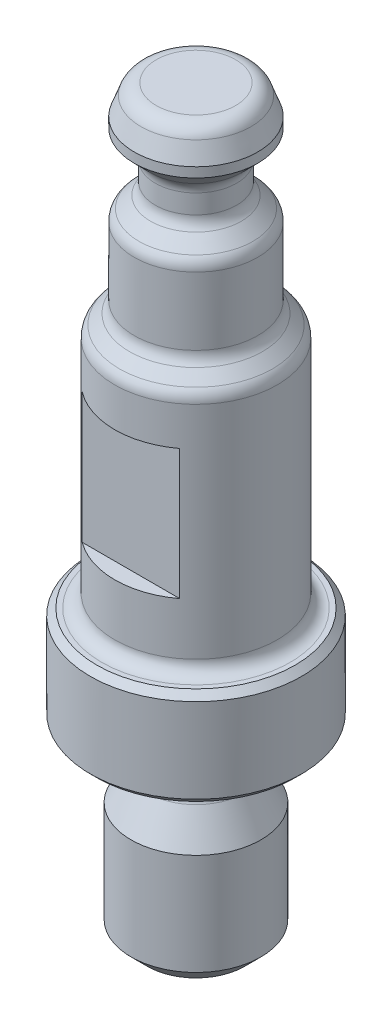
ISO-10303-21;
HEADER;
FILE_DESCRIPTION(('STEP AP214'),'2;1');
FILE_NAME('part.step','',(''),(''),'','','');
FILE_SCHEMA(('AUTOMOTIVE_DESIGN { 1 0 10303 214 1 1 1 1 }'));
ENDSEC;
DATA;
#1=APPLICATION_CONTEXT('core data for automotive mechanical design processes');
#2=APPLICATION_PROTOCOL_DEFINITION('international standard','automotive_design',2000,#1);
#3=PRODUCT_CONTEXT('',#1,'mechanical');
#4=PRODUCT('Part','Part','',(#3));
#5=PRODUCT_RELATED_PRODUCT_CATEGORY('part','',(#4));
#6=PRODUCT_DEFINITION_FORMATION('','',#4);
#7=PRODUCT_DEFINITION_CONTEXT('part definition',#1,'design');
#8=PRODUCT_DEFINITION('design','',#6,#7);
#9=PRODUCT_DEFINITION_SHAPE('','',#8);
#10=(LENGTH_UNIT() NAMED_UNIT(*) SI_UNIT(.MILLI.,.METRE.));
#11=(NAMED_UNIT(*) PLANE_ANGLE_UNIT() SI_UNIT($,.RADIAN.));
#12=(NAMED_UNIT(*) SI_UNIT($,.STERADIAN.) SOLID_ANGLE_UNIT());
#13=UNCERTAINTY_MEASURE_WITH_UNIT(LENGTH_MEASURE(1.E-05),#10,'distance_accuracy_value','');
#14=(GEOMETRIC_REPRESENTATION_CONTEXT(3) GLOBAL_UNCERTAINTY_ASSIGNED_CONTEXT((#13)) GLOBAL_UNIT_ASSIGNED_CONTEXT((#10,
#11,#12)) REPRESENTATION_CONTEXT('',''));
#15=CARTESIAN_POINT('',(0.,0.,0.));
#16=DIRECTION('',(0.,0.,1.));
#17=DIRECTION('',(1.,0.,0.));
#18=AXIS2_PLACEMENT_3D('',#15,#16,#17);
#19=CARTESIAN_POINT('',(0.,0.,0.));
#20=DIRECTION('',(0.,-1.,0.));
#21=DIRECTION('',(0.,0.,-1.));
#22=AXIS2_PLACEMENT_3D('',#19,#20,#21);
#23=CYLINDRICAL_SURFACE('',#22,1.9);
#24=CARTESIAN_POINT('',(0.,16.1,0.));
#25=DIRECTION('',(0.,-1.,0.));
#26=DIRECTION('',(0.,0.,-1.));
#27=AXIS2_PLACEMENT_3D('',#24,#25,#26);
#28=CIRCLE('',#27,1.9);
#29=CARTESIAN_POINT('',(0.,16.1,-1.9));
#30=VERTEX_POINT('',#29);
#31=EDGE_CURVE('E105',#30,#30,#28,.T.);
#32=ORIENTED_EDGE('',*,*,#31,.T.);
#33=EDGE_LOOP('',(#32));
#34=FACE_BOUND('',#33,.T.);
#35=CARTESIAN_POINT('',(0.,15.8,0.));
#36=DIRECTION('',(0.,-1.,0.));
#37=DIRECTION('',(0.,0.,-1.));
#38=AXIS2_PLACEMENT_3D('',#35,#36,#37);
#39=CIRCLE('',#38,1.9);
#40=CARTESIAN_POINT('',(0.,15.8,-1.9));
#41=VERTEX_POINT('',#40);
#42=EDGE_CURVE('E87',#41,#41,#39,.T.);
#43=ORIENTED_EDGE('',*,*,#42,.F.);
#44=EDGE_LOOP('',(#43));
#45=FACE_BOUND('',#44,.T.);
#46=ADVANCED_FACE('F15',(#34,#45),#23,.T.);
#47=CARTESIAN_POINT('',(0.,16.1,0.));
#48=DIRECTION('',(0.,-1.,0.));
#49=DIRECTION('',(0.,0.,-1.));
#50=AXIS2_PLACEMENT_3D('',#47,#48,#49);
#51=CONICAL_SURFACE('',#50,1.9,0.349065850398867);
#52=CARTESIAN_POINT('',(0.,16.6710100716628,0.));
#53=DIRECTION('',(0.,1.,0.));
#54=DIRECTION('',(0.,0.,1.));
#55=AXIS2_PLACEMENT_3D('',#52,#53,#54);
#56=CIRCLE('',#55,1.69216933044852);
#57=CARTESIAN_POINT('',(0.,16.6710100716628,1.69216933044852));
#58=VERTEX_POINT('',#57);
#59=EDGE_CURVE('E109',#58,#58,#56,.F.);
#60=ORIENTED_EDGE('',*,*,#59,.T.);
#61=EDGE_LOOP('',(#60));
#62=FACE_BOUND('',#61,.T.);
#63=ORIENTED_EDGE('',*,*,#31,.F.);
#64=EDGE_LOOP('',(#63));
#65=FACE_BOUND('',#64,.T.);
#66=ADVANCED_FACE('F225',(#62,#65),#51,.T.);
#67=CARTESIAN_POINT('',(0.,17.,0.));
#68=DIRECTION('',(0.,1.,0.));
#69=DIRECTION('',(0.,0.,1.));
#70=AXIS2_PLACEMENT_3D('',#67,#68,#69);
#71=PLANE('',#70);
#72=CARTESIAN_POINT('',(0.,17.,0.));
#73=DIRECTION('',(0.,1.,0.));
#74=DIRECTION('',(0.,0.,1.));
#75=AXIS2_PLACEMENT_3D('',#72,#73,#74);
#76=CIRCLE('',#75,1.22232302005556);
#77=CARTESIAN_POINT('',(0.,17.,1.22232302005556));
#78=VERTEX_POINT('',#77);
#79=EDGE_CURVE('E113',#78,#78,#76,.T.);
#80=ORIENTED_EDGE('',*,*,#79,.T.);
#81=EDGE_LOOP('',(#80));
#82=FACE_BOUND('',#81,.T.);
#83=ADVANCED_FACE('F231',(#82),#71,.T.);
#84=CARTESIAN_POINT('',(1.5,-5.8,0.));
#85=DIRECTION('',(0.,-1.,0.));
#86=DIRECTION('',(0.,0.,-1.));
#87=AXIS2_PLACEMENT_3D('',#84,#85,#86);
#88=PLANE('',#87);
#89=CARTESIAN_POINT('',(0.,-5.8,0.));
#90=DIRECTION('',(0.,-1.,0.));
#91=DIRECTION('',(0.,0.,-1.));
#92=AXIS2_PLACEMENT_3D('',#89,#90,#91);
#93=CIRCLE('',#92,1.5);
#94=CARTESIAN_POINT('',(0.,-5.8,-1.5));
#95=VERTEX_POINT('',#94);
#96=EDGE_CURVE('E101',#95,#95,#93,.T.);
#97=ORIENTED_EDGE('',*,*,#96,.T.);
#98=EDGE_LOOP('',(#97));
#99=FACE_BOUND('',#98,.T.);
#100=ADVANCED_FACE('F323',(#99),#88,.T.);
#101=CARTESIAN_POINT('',(0.,-5.8,0.));
#102=DIRECTION('',(0.,1.,0.));
#103=DIRECTION('',(0.,0.,1.));
#104=AXIS2_PLACEMENT_3D('',#101,#102,#103);
#105=CONICAL_SURFACE('',#104,1.5,0.785398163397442);
#106=CARTESIAN_POINT('',(0.,-5.3,0.));
#107=DIRECTION('',(0.,-1.,0.));
#108=DIRECTION('',(0.,0.,-1.));
#109=AXIS2_PLACEMENT_3D('',#106,#107,#108);
#110=CIRCLE('',#109,2.);
#111=CARTESIAN_POINT('',(0.,-5.3,-2.));
#112=VERTEX_POINT('',#111);
#113=EDGE_CURVE('E97',#112,#112,#110,.T.);
#114=ORIENTED_EDGE('',*,*,#113,.T.);
#115=EDGE_LOOP('',(#114));
#116=FACE_BOUND('',#115,.T.);
#117=ORIENTED_EDGE('',*,*,#96,.F.);
#118=EDGE_LOOP('',(#117));
#119=FACE_BOUND('',#118,.T.);
#120=ADVANCED_FACE('F319',(#116,#119),#105,.T.);
#121=CARTESIAN_POINT('',(0.,0.,0.));
#122=DIRECTION('',(0.,-1.,0.));
#123=DIRECTION('',(0.,0.,-1.));
#124=AXIS2_PLACEMENT_3D('',#121,#122,#123);
#125=CYLINDRICAL_SURFACE('',#124,2.);
#126=CARTESIAN_POINT('',(0.,-2.17943577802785,0.));
#127=DIRECTION('',(0.,-1.,0.));
#128=DIRECTION('',(0.,0.,-1.));
#129=AXIS2_PLACEMENT_3D('',#126,#127,#128);
#130=CIRCLE('',#129,2.);
#131=CARTESIAN_POINT('',(0.,-2.17943577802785,-2.));
#132=VERTEX_POINT('',#131);
#133=EDGE_CURVE('E93',#132,#132,#130,.T.);
#134=ORIENTED_EDGE('',*,*,#133,.T.);
#135=EDGE_LOOP('',(#134));
#136=FACE_BOUND('',#135,.T.);
#137=ORIENTED_EDGE('',*,*,#113,.F.);
#138=EDGE_LOOP('',(#137));
#139=FACE_BOUND('',#138,.T.);
#140=ADVANCED_FACE('F315',(#136,#139),#125,.T.);
#141=CARTESIAN_POINT('',(0.,-2.17943577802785,0.));
#142=DIRECTION('',(0.,-1.,0.));
#143=DIRECTION('',(0.,0.,-1.));
#144=AXIS2_PLACEMENT_3D('',#141,#142,#143);
#145=CONICAL_SURFACE('',#144,2.,0.471238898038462);
#146=CARTESIAN_POINT('',(0.,-1.18556469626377,0.));
#147=DIRECTION('',(0.,-1.,0.));
#148=DIRECTION('',(0.,0.,-1.));
#149=AXIS2_PLACEMENT_3D('',#146,#147,#148);
#150=CIRCLE('',#149,1.49359739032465);
#151=CARTESIAN_POINT('',(0.,-1.18556469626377,-1.49359739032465));
#152=VERTEX_POINT('',#151);
#153=EDGE_CURVE('E133',#152,#152,#150,.T.);
#154=ORIENTED_EDGE('',*,*,#153,.T.);
#155=EDGE_LOOP('',(#154));
#156=FACE_BOUND('',#155,.T.);
#157=ORIENTED_EDGE('',*,*,#133,.F.);
#158=EDGE_LOOP('',(#157));
#159=FACE_BOUND('',#158,.T.);
#160=ADVANCED_FACE('F311',(#156,#159),#145,.T.);
#161=CARTESIAN_POINT('',(0.,0.,0.));
#162=DIRECTION('',(0.,-1.,0.));
#163=DIRECTION('',(0.,0.,-1.));
#164=AXIS2_PLACEMENT_3D('',#161,#162,#163);
#165=CYLINDRICAL_SURFACE('',#164,1.45);
#166=CARTESIAN_POINT('',(0.,-1.00396849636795,0.));
#167=DIRECTION('',(0.,-1.,0.));
#168=DIRECTION('',(0.,0.,-1.));
#169=AXIS2_PLACEMENT_3D('',#166,#167,#168);
#170=CIRCLE('',#169,1.45);
#171=CARTESIAN_POINT('',(0.,-1.00396849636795,-1.45));
#172=VERTEX_POINT('',#171);
#173=EDGE_CURVE('E141',#172,#172,#170,.F.);
#174=ORIENTED_EDGE('',*,*,#173,.T.);
#175=EDGE_LOOP('',(#174));
#176=FACE_BOUND('',#175,.T.);
#177=CARTESIAN_POINT('',(0.,-0.4,0.));
#178=DIRECTION('',(0.,-1.,0.));
#179=DIRECTION('',(0.,0.,-1.));
#180=AXIS2_PLACEMENT_3D('',#177,#178,#179);
#181=CIRCLE('',#180,1.45);
#182=CARTESIAN_POINT('',(0.,-0.4,-1.45));
#183=VERTEX_POINT('',#182);
#184=EDGE_CURVE('E137',#183,#183,#181,.T.);
#185=ORIENTED_EDGE('',*,*,#184,.T.);
#186=EDGE_LOOP('',(#185));
#187=FACE_BOUND('',#186,.T.);
#188=ADVANCED_FACE('F307',(#176,#187),#165,.T.);
#189=CARTESIAN_POINT('',(3.25,0.,0.));
#190=DIRECTION('',(0.,-1.,0.));
#191=DIRECTION('',(0.,0.,-1.));
#192=AXIS2_PLACEMENT_3D('',#189,#190,#191);
#193=PLANE('',#192);
#194=CARTESIAN_POINT('',(0.,0.,0.));
#195=DIRECTION('',(0.,-1.,0.));
#196=DIRECTION('',(0.,0.,-1.));
#197=AXIS2_PLACEMENT_3D('',#194,#195,#196);
#198=CIRCLE('',#197,1.85);
#199=CARTESIAN_POINT('',(0.,0.,-1.85));
#200=VERTEX_POINT('',#199);
#201=EDGE_CURVE('E145',#200,#200,#198,.F.);
#202=ORIENTED_EDGE('',*,*,#201,.T.);
#203=EDGE_LOOP('',(#202));
#204=FACE_BOUND('',#203,.T.);
#205=CARTESIAN_POINT('',(0.,0.,0.));
#206=DIRECTION('',(0.,-1.,0.));
#207=DIRECTION('',(0.,0.,-1.));
#208=AXIS2_PLACEMENT_3D('',#205,#206,#207);
#209=CIRCLE('',#208,3.05);
#210=CARTESIAN_POINT('',(0.,0.,-3.05));
#211=VERTEX_POINT('',#210);
#212=EDGE_CURVE('E129',#211,#211,#209,.T.);
#213=ORIENTED_EDGE('',*,*,#212,.T.);
#214=EDGE_LOOP('',(#213));
#215=FACE_BOUND('',#214,.T.);
#216=ADVANCED_FACE('F303',(#204,#215),#193,.T.);
#217=CARTESIAN_POINT('',(0.,0.,0.));
#218=DIRECTION('',(0.,-1.,0.));
#219=DIRECTION('',(0.,0.,-1.));
#220=AXIS2_PLACEMENT_3D('',#217,#218,#219);
#221=CYLINDRICAL_SURFACE('',#220,3.25);
#222=CARTESIAN_POINT('',(0.,2.8,0.));
#223=DIRECTION('',(0.,1.,0.));
#224=DIRECTION('',(0.,0.,1.));
#225=AXIS2_PLACEMENT_3D('',#222,#223,#224);
#226=CIRCLE('',#225,3.25);
#227=CARTESIAN_POINT('',(0.,2.8,3.25));
#228=VERTEX_POINT('',#227);
#229=EDGE_CURVE('E121',#228,#228,#226,.F.);
#230=ORIENTED_EDGE('',*,*,#229,.T.);
#231=EDGE_LOOP('',(#230));
#232=FACE_BOUND('',#231,.T.);
#233=CARTESIAN_POINT('',(0.,0.2,0.));
#234=DIRECTION('',(0.,-1.,0.));
#235=DIRECTION('',(0.,0.,-1.));
#236=AXIS2_PLACEMENT_3D('',#233,#234,#235);
#237=CIRCLE('',#236,3.25);
#238=CARTESIAN_POINT('',(0.,0.2,-3.25));
#239=VERTEX_POINT('',#238);
#240=EDGE_CURVE('E117',#239,#239,#237,.F.);
#241=ORIENTED_EDGE('',*,*,#240,.T.);
#242=EDGE_LOOP('',(#241));
#243=FACE_BOUND('',#242,.T.);
#244=ADVANCED_FACE('F296',(#232,#243),#221,.T.);
#245=CARTESIAN_POINT('',(2.5,3.,0.));
#246=DIRECTION('',(0.,1.,0.));
#247=DIRECTION('',(0.,0.,1.));
#248=AXIS2_PLACEMENT_3D('',#245,#246,#247);
#249=PLANE('',#248);
#250=CARTESIAN_POINT('',(0.,3.,0.));
#251=DIRECTION('',(0.,1.,0.));
#252=DIRECTION('',(0.,0.,1.));
#253=AXIS2_PLACEMENT_3D('',#250,#251,#252);
#254=CIRCLE('',#253,2.9);
#255=CARTESIAN_POINT('',(0.,3.,2.9));
#256=VERTEX_POINT('',#255);
#257=EDGE_CURVE('E189',#256,#256,#254,.F.);
#258=ORIENTED_EDGE('',*,*,#257,.T.);
#259=EDGE_LOOP('',(#258));
#260=FACE_BOUND('',#259,.T.);
#261=CARTESIAN_POINT('',(0.,3.,0.));
#262=DIRECTION('',(0.,1.,0.));
#263=DIRECTION('',(0.,0.,1.));
#264=AXIS2_PLACEMENT_3D('',#261,#262,#263);
#265=CIRCLE('',#264,3.05);
#266=CARTESIAN_POINT('',(0.,3.,3.05));
#267=VERTEX_POINT('',#266);
#268=EDGE_CURVE('E125',#267,#267,#265,.T.);
#269=ORIENTED_EDGE('',*,*,#268,.T.);
#270=EDGE_LOOP('',(#269));
#271=FACE_BOUND('',#270,.T.);
#272=ADVANCED_FACE('F287',(#260,#271),#249,.T.);
#273=CARTESIAN_POINT('',(0.,0.,0.));
#274=DIRECTION('',(0.,-1.,0.));
#275=DIRECTION('',(0.,0.,-1.));
#276=AXIS2_PLACEMENT_3D('',#273,#274,#275);
#277=CYLINDRICAL_SURFACE('',#276,2.5);
#278=DIRECTION('',(0.,-1.,0.));
#279=VECTOR('',#278,1.);
#280=CARTESIAN_POINT('',(-1.5,0.,-2.));
#281=LINE('',#280,#279);
#282=CARTESIAN_POINT('',(-1.5,5.,-2.));
#283=VERTEX_POINT('',#282);
#284=CARTESIAN_POINT('',(-1.5,9.,-2.));
#285=VERTEX_POINT('',#284);
#286=EDGE_CURVE('E24',#283,#285,#281,.F.);
#287=ORIENTED_EDGE('',*,*,#286,.F.);
#288=CARTESIAN_POINT('',(0.,5.,0.));
#289=DIRECTION('',(0.,-1.,0.));
#290=DIRECTION('',(0.,0.,-1.));
#291=AXIS2_PLACEMENT_3D('',#288,#289,#290);
#292=CIRCLE('',#291,2.5);
#293=CARTESIAN_POINT('',(1.5,5.,-2.));
#294=VERTEX_POINT('',#293);
#295=EDGE_CURVE('E9',#294,#283,#292,.F.);
#296=ORIENTED_EDGE('',*,*,#295,.F.);
#297=DIRECTION('',(0.,-1.,0.));
#298=VECTOR('',#297,1.);
#299=CARTESIAN_POINT('',(1.5,0.,-2.));
#300=LINE('',#299,#298);
#301=CARTESIAN_POINT('',(1.5,9.,-2.));
#302=VERTEX_POINT('',#301);
#303=EDGE_CURVE('E62',#302,#294,#300,.T.);
#304=ORIENTED_EDGE('',*,*,#303,.F.);
#305=CARTESIAN_POINT('',(0.,9.,0.));
#306=DIRECTION('',(0.,1.,0.));
#307=DIRECTION('',(0.,0.,1.));
#308=AXIS2_PLACEMENT_3D('',#305,#306,#307);
#309=CIRCLE('',#308,2.5);
#310=EDGE_CURVE('E57',#285,#302,#309,.F.);
#311=ORIENTED_EDGE('',*,*,#310,.F.);
#312=EDGE_LOOP('',(#287,#296,#304,#311));
#313=FACE_BOUND('',#312,.T.);
#314=DIRECTION('',(0.,-1.,0.));
#315=VECTOR('',#314,1.);
#316=CARTESIAN_POINT('',(-1.5,0.,2.));
#317=LINE('',#316,#315);
#318=CARTESIAN_POINT('',(-1.5,9.,2.));
#319=VERTEX_POINT('',#318);
#320=CARTESIAN_POINT('',(-1.5,5.,2.));
#321=VERTEX_POINT('',#320);
#322=EDGE_CURVE('E200',#319,#321,#317,.T.);
#323=ORIENTED_EDGE('',*,*,#322,.F.);
#324=CARTESIAN_POINT('',(0.,9.,0.));
#325=DIRECTION('',(0.,1.,0.));
#326=DIRECTION('',(0.,0.,1.));
#327=AXIS2_PLACEMENT_3D('',#324,#325,#326);
#328=CIRCLE('',#327,2.5);
#329=CARTESIAN_POINT('',(1.5,9.,2.));
#330=VERTEX_POINT('',#329);
#331=EDGE_CURVE('E37',#330,#319,#328,.F.);
#332=ORIENTED_EDGE('',*,*,#331,.F.);
#333=DIRECTION('',(0.,-1.,0.));
#334=VECTOR('',#333,1.);
#335=CARTESIAN_POINT('',(1.5,0.,2.));
#336=LINE('',#335,#334);
#337=CARTESIAN_POINT('',(1.5,5.,2.));
#338=VERTEX_POINT('',#337);
#339=EDGE_CURVE('E31',#338,#330,#336,.F.);
#340=ORIENTED_EDGE('',*,*,#339,.F.);
#341=CARTESIAN_POINT('',(0.,5.,0.));
#342=DIRECTION('',(0.,-1.,0.));
#343=DIRECTION('',(0.,0.,-1.));
#344=AXIS2_PLACEMENT_3D('',#341,#342,#343);
#345=CIRCLE('',#344,2.5);
#346=EDGE_CURVE('E197',#321,#338,#345,.F.);
#347=ORIENTED_EDGE('',*,*,#346,.F.);
#348=EDGE_LOOP('',(#323,#332,#340,#347));
#349=FACE_BOUND('',#348,.T.);
#350=CARTESIAN_POINT('',(0.,3.4,0.));
#351=DIRECTION('',(0.,1.,0.));
#352=DIRECTION('',(0.,0.,1.));
#353=AXIS2_PLACEMENT_3D('',#350,#351,#352);
#354=CIRCLE('',#353,2.5);
#355=CARTESIAN_POINT('',(0.,3.4,2.5));
#356=VERTEX_POINT('',#355);
#357=EDGE_CURVE('E193',#356,#356,#354,.T.);
#358=ORIENTED_EDGE('',*,*,#357,.T.);
#359=EDGE_LOOP('',(#358));
#360=FACE_BOUND('',#359,.T.);
#361=CARTESIAN_POINT('',(0.,10.1928932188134,0.));
#362=DIRECTION('',(0.,1.,0.));
#363=DIRECTION('',(0.,0.,1.));
#364=AXIS2_PLACEMENT_3D('',#361,#362,#363);
#365=CIRCLE('',#364,2.5);
#366=CARTESIAN_POINT('',(0.,10.1928932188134,2.5));
#367=VERTEX_POINT('',#366);
#368=EDGE_CURVE('E185',#367,#367,#365,.F.);
#369=ORIENTED_EDGE('',*,*,#368,.T.);
#370=EDGE_LOOP('',(#369));
#371=FACE_BOUND('',#370,.T.);
#372=ADVANCED_FACE('F59',(#313,#349,#360,#371),#277,.T.);
#373=CARTESIAN_POINT('',(0.,10.4,0.));
#374=DIRECTION('',(0.,-1.,0.));
#375=DIRECTION('',(0.,0.,-1.));
#376=AXIS2_PLACEMENT_3D('',#373,#374,#375);
#377=CONICAL_SURFACE('',#376,2.5,0.785398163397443);
#378=CARTESIAN_POINT('',(0.,10.8535533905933,0.));
#379=DIRECTION('',(0.,-1.,0.));
#380=DIRECTION('',(0.,0.,-1.));
#381=AXIS2_PLACEMENT_3D('',#378,#379,#380);
#382=CIRCLE('',#381,2.04644660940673);
#383=CARTESIAN_POINT('',(0.,10.8535533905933,-2.04644660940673));
#384=VERTEX_POINT('',#383);
#385=EDGE_CURVE('E173',#384,#384,#382,.T.);
#386=ORIENTED_EDGE('',*,*,#385,.T.);
#387=EDGE_LOOP('',(#386));
#388=FACE_BOUND('',#387,.T.);
#389=CARTESIAN_POINT('',(0.,10.5464466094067,0.));
#390=DIRECTION('',(0.,1.,0.));
#391=DIRECTION('',(0.,0.,1.));
#392=AXIS2_PLACEMENT_3D('',#389,#390,#391);
#393=CIRCLE('',#392,2.35355339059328);
#394=CARTESIAN_POINT('',(0.,10.5464466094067,2.35355339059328));
#395=VERTEX_POINT('',#394);
#396=EDGE_CURVE('E169',#395,#395,#393,.T.);
#397=ORIENTED_EDGE('',*,*,#396,.T.);
#398=EDGE_LOOP('',(#397));
#399=FACE_BOUND('',#398,.T.);
#400=ADVANCED_FACE('F286',(#388,#399),#377,.T.);
#401=CARTESIAN_POINT('',(0.,0.,0.));
#402=DIRECTION('',(0.,-1.,0.));
#403=DIRECTION('',(0.,0.,-1.));
#404=AXIS2_PLACEMENT_3D('',#401,#402,#403);
#405=CYLINDRICAL_SURFACE('',#404,1.9);
#406=CARTESIAN_POINT('',(0.,11.2071067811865,0.));
#407=DIRECTION('',(0.,-1.,0.));
#408=DIRECTION('',(0.,0.,-1.));
#409=AXIS2_PLACEMENT_3D('',#406,#407,#408);
#410=CIRCLE('',#409,1.9);
#411=CARTESIAN_POINT('',(0.,11.2071067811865,-1.9));
#412=VERTEX_POINT('',#411);
#413=EDGE_CURVE('E181',#412,#412,#410,.F.);
#414=ORIENTED_EDGE('',*,*,#413,.T.);
#415=EDGE_LOOP('',(#414));
#416=FACE_BOUND('',#415,.T.);
#417=CARTESIAN_POINT('',(0.,13.2928932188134,0.));
#418=DIRECTION('',(0.,1.,0.));
#419=DIRECTION('',(0.,0.,1.));
#420=AXIS2_PLACEMENT_3D('',#417,#418,#419);
#421=CIRCLE('',#420,1.9);
#422=CARTESIAN_POINT('',(0.,13.2928932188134,1.9));
#423=VERTEX_POINT('',#422);
#424=EDGE_CURVE('E177',#423,#423,#421,.F.);
#425=ORIENTED_EDGE('',*,*,#424,.T.);
#426=EDGE_LOOP('',(#425));
#427=FACE_BOUND('',#426,.T.);
#428=ADVANCED_FACE('F293',(#416,#427),#405,.T.);
#429=CARTESIAN_POINT('',(0.,13.5,0.));
#430=DIRECTION('',(0.,-1.,0.));
#431=DIRECTION('',(0.,0.,-1.));
#432=AXIS2_PLACEMENT_3D('',#429,#430,#431);
#433=CONICAL_SURFACE('',#432,1.9,0.785398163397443);
#434=CARTESIAN_POINT('',(0.,14.0035533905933,0.));
#435=DIRECTION('',(0.,-1.,0.));
#436=DIRECTION('',(0.,0.,-1.));
#437=AXIS2_PLACEMENT_3D('',#434,#435,#436);
#438=CIRCLE('',#437,1.39644660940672);
#439=CARTESIAN_POINT('',(0.,14.0035533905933,-1.39644660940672));
#440=VERTEX_POINT('',#439);
#441=EDGE_CURVE('E165',#440,#440,#438,.T.);
#442=ORIENTED_EDGE('',*,*,#441,.T.);
#443=EDGE_LOOP('',(#442));
#444=FACE_BOUND('',#443,.T.);
#445=CARTESIAN_POINT('',(0.,13.6464466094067,0.));
#446=DIRECTION('',(0.,1.,0.));
#447=DIRECTION('',(0.,0.,1.));
#448=AXIS2_PLACEMENT_3D('',#445,#446,#447);
#449=CIRCLE('',#448,1.75355339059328);
#450=CARTESIAN_POINT('',(0.,13.6464466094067,1.75355339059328));
#451=VERTEX_POINT('',#450);
#452=EDGE_CURVE('E161',#451,#451,#449,.T.);
#453=ORIENTED_EDGE('',*,*,#452,.T.);
#454=EDGE_LOOP('',(#453));
#455=FACE_BOUND('',#454,.T.);
#456=ADVANCED_FACE('F405',(#444,#455),#433,.T.);
#457=CARTESIAN_POINT('',(0.,0.,0.));
#458=DIRECTION('',(0.,-1.,0.));
#459=DIRECTION('',(0.,0.,-1.));
#460=AXIS2_PLACEMENT_3D('',#457,#458,#459);
#461=CYLINDRICAL_SURFACE('',#460,1.25);
#462=CARTESIAN_POINT('',(0.,14.9428932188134,0.));
#463=DIRECTION('',(0.,-1.,0.));
#464=DIRECTION('',(0.,0.,-1.));
#465=AXIS2_PLACEMENT_3D('',#462,#463,#464);
#466=CIRCLE('',#465,1.25);
#467=CARTESIAN_POINT('',(0.,14.9428932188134,-1.25));
#468=VERTEX_POINT('',#467);
#469=EDGE_CURVE('E153',#468,#468,#466,.T.);
#470=ORIENTED_EDGE('',*,*,#469,.T.);
#471=EDGE_LOOP('',(#470));
#472=FACE_BOUND('',#471,.T.);
#473=CARTESIAN_POINT('',(0.,14.3571067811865,0.));
#474=DIRECTION('',(0.,-1.,0.));
#475=DIRECTION('',(0.,0.,-1.));
#476=AXIS2_PLACEMENT_3D('',#473,#474,#475);
#477=CIRCLE('',#476,1.25);
#478=CARTESIAN_POINT('',(0.,14.3571067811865,-1.25));
#479=VERTEX_POINT('',#478);
#480=EDGE_CURVE('E149',#479,#479,#477,.F.);
#481=ORIENTED_EDGE('',*,*,#480,.T.);
#482=EDGE_LOOP('',(#481));
#483=FACE_BOUND('',#482,.T.);
#484=ADVANCED_FACE('F414',(#472,#483),#461,.T.);
#485=CARTESIAN_POINT('',(0.,15.15,0.));
#486=DIRECTION('',(0.,1.,0.));
#487=DIRECTION('',(0.,0.,1.));
#488=AXIS2_PLACEMENT_3D('',#485,#486,#487);
#489=CONICAL_SURFACE('',#488,1.25,0.785398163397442);
#490=CARTESIAN_POINT('',(0.,15.2964466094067,0.));
#491=DIRECTION('',(0.,1.,0.));
#492=DIRECTION('',(0.,0.,1.));
#493=AXIS2_PLACEMENT_3D('',#490,#491,#492);
#494=CIRCLE('',#493,1.39644660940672);
#495=CARTESIAN_POINT('',(0.,15.2964466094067,1.39644660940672));
#496=VERTEX_POINT('',#495);
#497=EDGE_CURVE('E157',#496,#496,#494,.T.);
#498=ORIENTED_EDGE('',*,*,#497,.T.);
#499=EDGE_LOOP('',(#498));
#500=FACE_BOUND('',#499,.T.);
#501=ORIENTED_EDGE('',*,*,#42,.T.);
#502=EDGE_LOOP('',(#501));
#503=FACE_BOUND('',#502,.T.);
#504=ADVANCED_FACE('F241',(#500,#503),#489,.T.);
#505=CARTESIAN_POINT('',(0.,16.5,0.));
#506=DIRECTION('',(0.,1.,0.));
#507=DIRECTION('',(0.,0.,1.));
#508=AXIS2_PLACEMENT_3D('',#505,#506,#507);
#509=TOROIDAL_SURFACE('',#508,1.22232302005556,0.5);
#510=ORIENTED_EDGE('',*,*,#79,.F.);
#511=EDGE_LOOP('',(#510));
#512=FACE_BOUND('',#511,.T.);
#513=ORIENTED_EDGE('',*,*,#59,.F.);
#514=EDGE_LOOP('',(#513));
#515=FACE_BOUND('',#514,.T.);
#516=ADVANCED_FACE('F237',(#512,#515),#509,.T.);
#517=CARTESIAN_POINT('',(0.,2.8,0.));
#518=DIRECTION('',(0.,-1.,0.));
#519=DIRECTION('',(0.,0.,-1.));
#520=AXIS2_PLACEMENT_3D('',#517,#518,#519);
#521=CONICAL_SURFACE('',#520,3.25,0.785398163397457);
#522=ORIENTED_EDGE('',*,*,#268,.F.);
#523=EDGE_LOOP('',(#522));
#524=FACE_BOUND('',#523,.T.);
#525=ORIENTED_EDGE('',*,*,#229,.F.);
#526=EDGE_LOOP('',(#525));
#527=FACE_BOUND('',#526,.T.);
#528=ADVANCED_FACE('F240',(#524,#527),#521,.T.);
#529=CARTESIAN_POINT('',(0.,0.,0.));
#530=DIRECTION('',(0.,1.,0.));
#531=DIRECTION('',(0.,0.,1.));
#532=AXIS2_PLACEMENT_3D('',#529,#530,#531);
#533=CONICAL_SURFACE('',#532,3.05,0.785398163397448);
#534=ORIENTED_EDGE('',*,*,#240,.F.);
#535=EDGE_LOOP('',(#534));
#536=FACE_BOUND('',#535,.T.);
#537=ORIENTED_EDGE('',*,*,#212,.F.);
#538=EDGE_LOOP('',(#537));
#539=FACE_BOUND('',#538,.T.);
#540=ADVANCED_FACE('F245',(#536,#539),#533,.T.);
#541=CARTESIAN_POINT('',(0.,-1.00396849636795,0.));
#542=DIRECTION('',(0.,-1.,0.));
#543=DIRECTION('',(0.,0.,-1.));
#544=AXIS2_PLACEMENT_3D('',#541,#542,#543);
#545=TOROIDAL_SURFACE('',#544,1.85,0.4);
#546=ORIENTED_EDGE('',*,*,#173,.F.);
#547=EDGE_LOOP('',(#546));
#548=FACE_BOUND('',#547,.T.);
#549=ORIENTED_EDGE('',*,*,#153,.F.);
#550=EDGE_LOOP('',(#549));
#551=FACE_BOUND('',#550,.T.);
#552=ADVANCED_FACE('F249',(#548,#551),#545,.F.);
#553=CARTESIAN_POINT('',(0.,-0.4,0.));
#554=DIRECTION('',(0.,-1.,0.));
#555=DIRECTION('',(0.,0.,-1.));
#556=AXIS2_PLACEMENT_3D('',#553,#554,#555);
#557=TOROIDAL_SURFACE('',#556,1.85,0.4);
#558=ORIENTED_EDGE('',*,*,#201,.F.);
#559=EDGE_LOOP('',(#558));
#560=FACE_BOUND('',#559,.T.);
#561=ORIENTED_EDGE('',*,*,#184,.F.);
#562=EDGE_LOOP('',(#561));
#563=FACE_BOUND('',#562,.T.);
#564=ADVANCED_FACE('F253',(#560,#563),#557,.F.);
#565=CARTESIAN_POINT('',(0.,14.9428932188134,0.));
#566=DIRECTION('',(0.,-1.,0.));
#567=DIRECTION('',(0.,0.,-1.));
#568=AXIS2_PLACEMENT_3D('',#565,#566,#567);
#569=TOROIDAL_SURFACE('',#568,1.75,0.5);
#570=ORIENTED_EDGE('',*,*,#497,.F.);
#571=EDGE_LOOP('',(#570));
#572=FACE_BOUND('',#571,.T.);
#573=ORIENTED_EDGE('',*,*,#469,.F.);
#574=EDGE_LOOP('',(#573));
#575=FACE_BOUND('',#574,.T.);
#576=ADVANCED_FACE('F257',(#572,#575),#569,.F.);
#577=CARTESIAN_POINT('',(0.,14.3571067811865,0.));
#578=DIRECTION('',(0.,-1.,0.));
#579=DIRECTION('',(0.,0.,-1.));
#580=AXIS2_PLACEMENT_3D('',#577,#578,#579);
#581=TOROIDAL_SURFACE('',#580,1.75,0.5);
#582=ORIENTED_EDGE('',*,*,#480,.F.);
#583=EDGE_LOOP('',(#582));
#584=FACE_BOUND('',#583,.T.);
#585=ORIENTED_EDGE('',*,*,#441,.F.);
#586=EDGE_LOOP('',(#585));
#587=FACE_BOUND('',#586,.T.);
#588=ADVANCED_FACE('F261',(#584,#587),#581,.F.);
#589=CARTESIAN_POINT('',(0.,11.2071067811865,0.));
#590=DIRECTION('',(0.,-1.,0.));
#591=DIRECTION('',(0.,0.,-1.));
#592=AXIS2_PLACEMENT_3D('',#589,#590,#591);
#593=TOROIDAL_SURFACE('',#592,2.4,0.5);
#594=ORIENTED_EDGE('',*,*,#413,.F.);
#595=EDGE_LOOP('',(#594));
#596=FACE_BOUND('',#595,.T.);
#597=ORIENTED_EDGE('',*,*,#385,.F.);
#598=EDGE_LOOP('',(#597));
#599=FACE_BOUND('',#598,.T.);
#600=ADVANCED_FACE('F265',(#596,#599),#593,.F.);
#601=CARTESIAN_POINT('',(0.,13.2928932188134,0.));
#602=DIRECTION('',(0.,1.,0.));
#603=DIRECTION('',(0.,0.,1.));
#604=AXIS2_PLACEMENT_3D('',#601,#602,#603);
#605=TOROIDAL_SURFACE('',#604,1.4,0.5);
#606=ORIENTED_EDGE('',*,*,#452,.F.);
#607=EDGE_LOOP('',(#606));
#608=FACE_BOUND('',#607,.T.);
#609=ORIENTED_EDGE('',*,*,#424,.F.);
#610=EDGE_LOOP('',(#609));
#611=FACE_BOUND('',#610,.T.);
#612=ADVANCED_FACE('F269',(#608,#611),#605,.T.);
#613=CARTESIAN_POINT('',(0.,10.1928932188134,0.));
#614=DIRECTION('',(0.,1.,0.));
#615=DIRECTION('',(0.,0.,1.));
#616=AXIS2_PLACEMENT_3D('',#613,#614,#615);
#617=TOROIDAL_SURFACE('',#616,2.,0.5);
#618=ORIENTED_EDGE('',*,*,#396,.F.);
#619=EDGE_LOOP('',(#618));
#620=FACE_BOUND('',#619,.T.);
#621=ORIENTED_EDGE('',*,*,#368,.F.);
#622=EDGE_LOOP('',(#621));
#623=FACE_BOUND('',#622,.T.);
#624=ADVANCED_FACE('F272',(#620,#623),#617,.T.);
#625=CARTESIAN_POINT('',(0.,3.4,0.));
#626=DIRECTION('',(0.,1.,0.));
#627=DIRECTION('',(0.,0.,1.));
#628=AXIS2_PLACEMENT_3D('',#625,#626,#627);
#629=TOROIDAL_SURFACE('',#628,2.9,0.4);
#630=ORIENTED_EDGE('',*,*,#357,.F.);
#631=EDGE_LOOP('',(#630));
#632=FACE_BOUND('',#631,.T.);
#633=ORIENTED_EDGE('',*,*,#257,.F.);
#634=EDGE_LOOP('',(#633));
#635=FACE_BOUND('',#634,.T.);
#636=ADVANCED_FACE('F17',(#632,#635),#629,.F.);
#637=CARTESIAN_POINT('',(-3.25,9.,2.5));
#638=DIRECTION('',(0.,1.,0.));
#639=DIRECTION('',(0.,0.,1.));
#640=AXIS2_PLACEMENT_3D('',#637,#638,#639);
#641=PLANE('',#640);
#642=ORIENTED_EDGE('',*,*,#331,.T.);
#643=DIRECTION('',(1.,0.,0.));
#644=VECTOR('',#643,1.);
#645=CARTESIAN_POINT('',(-3.25,9.,2.));
#646=LINE('',#645,#644);
#647=EDGE_CURVE('E84',#319,#330,#646,.T.);
#648=ORIENTED_EDGE('',*,*,#647,.T.);
#649=EDGE_LOOP('',(#642,#648));
#650=FACE_BOUND('',#649,.T.);
#651=ADVANCED_FACE('F279',(#650),#641,.F.);
#652=CARTESIAN_POINT('',(-3.25,9.,2.));
#653=DIRECTION('',(0.,0.,-1.));
#654=DIRECTION('',(0.,1.,0.));
#655=AXIS2_PLACEMENT_3D('',#652,#653,#654);
#656=PLANE('',#655);
#657=ORIENTED_EDGE('',*,*,#339,.T.);
#658=ORIENTED_EDGE('',*,*,#647,.F.);
#659=ORIENTED_EDGE('',*,*,#322,.T.);
#660=DIRECTION('',(1.,0.,0.));
#661=VECTOR('',#660,1.);
#662=CARTESIAN_POINT('',(-3.25,5.,2.));
#663=LINE('',#662,#661);
#664=EDGE_CURVE('E81',#321,#338,#663,.T.);
#665=ORIENTED_EDGE('',*,*,#664,.T.);
#666=EDGE_LOOP('',(#657,#658,#659,#665));
#667=FACE_BOUND('',#666,.T.);
#668=ADVANCED_FACE('F221',(#667),#656,.F.);
#669=CARTESIAN_POINT('',(-3.25,5.,2.5));
#670=DIRECTION('',(0.,-1.,0.));
#671=DIRECTION('',(0.,0.,-1.));
#672=AXIS2_PLACEMENT_3D('',#669,#670,#671);
#673=PLANE('',#672);
#674=ORIENTED_EDGE('',*,*,#664,.F.);
#675=ORIENTED_EDGE('',*,*,#346,.T.);
#676=EDGE_LOOP('',(#674,#675));
#677=FACE_BOUND('',#676,.T.);
#678=ADVANCED_FACE('F213',(#677),#673,.F.);
#679=CARTESIAN_POINT('',(-3.25,5.,-2.5));
#680=DIRECTION('',(0.,-1.,0.));
#681=DIRECTION('',(0.,0.,-1.));
#682=AXIS2_PLACEMENT_3D('',#679,#680,#681);
#683=PLANE('',#682);
#684=ORIENTED_EDGE('',*,*,#295,.T.);
#685=DIRECTION('',(1.,0.,0.));
#686=VECTOR('',#685,1.);
#687=CARTESIAN_POINT('',(-3.25,5.,-2.));
#688=LINE('',#687,#686);
#689=EDGE_CURVE('E73',#283,#294,#688,.T.);
#690=ORIENTED_EDGE('',*,*,#689,.T.);
#691=EDGE_LOOP('',(#684,#690));
#692=FACE_BOUND('',#691,.T.);
#693=ADVANCED_FACE('F211',(#692),#683,.F.);
#694=CARTESIAN_POINT('',(-3.25,9.,-2.));
#695=DIRECTION('',(0.,0.,1.));
#696=DIRECTION('',(0.,-1.,0.));
#697=AXIS2_PLACEMENT_3D('',#694,#695,#696);
#698=PLANE('',#697);
#699=ORIENTED_EDGE('',*,*,#286,.T.);
#700=DIRECTION('',(1.,0.,0.));
#701=VECTOR('',#700,1.);
#702=CARTESIAN_POINT('',(-3.25,9.,-2.));
#703=LINE('',#702,#701);
#704=EDGE_CURVE('E71',#285,#302,#703,.T.);
#705=ORIENTED_EDGE('',*,*,#704,.T.);
#706=ORIENTED_EDGE('',*,*,#303,.T.);
#707=ORIENTED_EDGE('',*,*,#689,.F.);
#708=EDGE_LOOP('',(#699,#705,#706,#707));
#709=FACE_BOUND('',#708,.T.);
#710=ADVANCED_FACE('F70',(#709),#698,.F.);
#711=CARTESIAN_POINT('',(-3.25,9.,-2.5));
#712=DIRECTION('',(0.,1.,0.));
#713=DIRECTION('',(0.,0.,1.));
#714=AXIS2_PLACEMENT_3D('',#711,#712,#713);
#715=PLANE('',#714);
#716=ORIENTED_EDGE('',*,*,#704,.F.);
#717=ORIENTED_EDGE('',*,*,#310,.T.);
#718=EDGE_LOOP('',(#716,#717));
#719=FACE_BOUND('',#718,.T.);
#720=ADVANCED_FACE('F75',(#719),#715,.F.);
#721=CLOSED_SHELL('',(#46,#66,#83,#100,#120,#140,#160,#188,#216,#244,#272,#372,#400,#428,#456,
#484,#504,#516,#528,#540,#552,#564,#576,#588,#600,#612,#624,#636,#651,#668,#678,#693,#710,#720));
#722=MANIFOLD_SOLID_BREP('B1',#721);
#723=ADVANCED_BREP_SHAPE_REPRESENTATION('',(#18,#722),#14);
#724=SHAPE_DEFINITION_REPRESENTATION(#9,#723);
ENDSEC;
END-ISO-10303-21;
